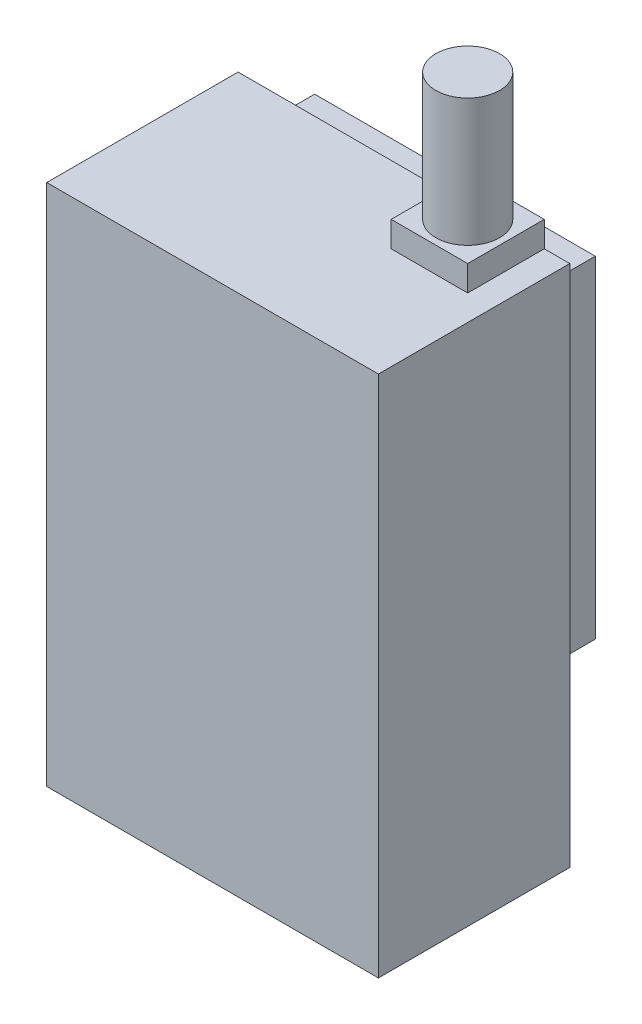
ISO-10303-21;
HEADER;
FILE_DESCRIPTION(('STEP AP214'),'2;1');
FILE_NAME('part.step','',(''),(''),'','','');
FILE_SCHEMA(('AUTOMOTIVE_DESIGN { 1 0 10303 214 1 1 1 1 }'));
ENDSEC;
DATA;
#1=APPLICATION_CONTEXT('core data for automotive mechanical design processes');
#2=APPLICATION_PROTOCOL_DEFINITION('international standard','automotive_design',2000,#1);
#3=PRODUCT_CONTEXT('',#1,'mechanical');
#4=PRODUCT('Part','Part','',(#3));
#5=PRODUCT_RELATED_PRODUCT_CATEGORY('part','',(#4));
#6=PRODUCT_DEFINITION_FORMATION('','',#4);
#7=PRODUCT_DEFINITION_CONTEXT('part definition',#1,'design');
#8=PRODUCT_DEFINITION('design','',#6,#7);
#9=PRODUCT_DEFINITION_SHAPE('','',#8);
#10=(LENGTH_UNIT() NAMED_UNIT(*) SI_UNIT(.MILLI.,.METRE.));
#11=(NAMED_UNIT(*) PLANE_ANGLE_UNIT() SI_UNIT($,.RADIAN.));
#12=(NAMED_UNIT(*) SI_UNIT($,.STERADIAN.) SOLID_ANGLE_UNIT());
#13=UNCERTAINTY_MEASURE_WITH_UNIT(LENGTH_MEASURE(1.E-05),#10,'distance_accuracy_value','');
#14=(GEOMETRIC_REPRESENTATION_CONTEXT(3) GLOBAL_UNCERTAINTY_ASSIGNED_CONTEXT((#13)) GLOBAL_UNIT_ASSIGNED_CONTEXT((#10,
#11,#12)) REPRESENTATION_CONTEXT('',''));
#15=CARTESIAN_POINT('',(0.,0.,0.));
#16=DIRECTION('',(0.,0.,1.));
#17=DIRECTION('',(1.,0.,0.));
#18=AXIS2_PLACEMENT_3D('',#15,#16,#17);
#19=CARTESIAN_POINT('',(-11.3200830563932,34.699792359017,0.));
#20=DIRECTION('',(0.,1.,0.));
#21=DIRECTION('',(0.,0.,1.));
#22=AXIS2_PLACEMENT_3D('',#19,#20,#21);
#23=PLANE('',#22);
#24=DIRECTION('',(0.,0.,1.));
#25=VECTOR('',#24,1.);
#26=CARTESIAN_POINT('',(-11.3200830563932,34.699792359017,6.));
#27=LINE('',#26,#25);
#28=CARTESIAN_POINT('',(-11.3200830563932,34.699792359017,0.));
#29=VERTEX_POINT('',#28);
#30=CARTESIAN_POINT('',(-11.3200830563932,34.699792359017,6.));
#31=VERTEX_POINT('',#30);
#32=EDGE_CURVE('E134',#29,#31,#27,.T.);
#33=ORIENTED_EDGE('',*,*,#32,.T.);
#34=DIRECTION('',(1.,0.,0.));
#35=VECTOR('',#34,1.);
#36=CARTESIAN_POINT('',(-5.32008305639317,34.699792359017,6.));
#37=LINE('',#36,#35);
#38=CARTESIAN_POINT('',(-5.32008305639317,34.699792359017,6.));
#39=VERTEX_POINT('',#38);
#40=EDGE_CURVE('E124',#31,#39,#37,.T.);
#41=ORIENTED_EDGE('',*,*,#40,.T.);
#42=DIRECTION('',(0.,0.,-1.));
#43=VECTOR('',#42,1.);
#44=CARTESIAN_POINT('',(-5.32008305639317,34.699792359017,6.));
#45=LINE('',#44,#43);
#46=CARTESIAN_POINT('',(-5.32008305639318,34.699792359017,0.));
#47=VERTEX_POINT('',#46);
#48=EDGE_CURVE('E133',#39,#47,#45,.T.);
#49=ORIENTED_EDGE('',*,*,#48,.T.);
#50=DIRECTION('',(-1.,0.,0.));
#51=VECTOR('',#50,1.);
#52=CARTESIAN_POINT('',(-5.32008305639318,34.699792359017,0.));
#53=LINE('',#52,#51);
#54=EDGE_CURVE('E139',#47,#29,#53,.T.);
#55=ORIENTED_EDGE('',*,*,#54,.T.);
#56=EDGE_LOOP('',(#33,#41,#49,#55));
#57=FACE_BOUND('',#56,.T.);
#58=CARTESIAN_POINT('',(-8.32008305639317,34.699792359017,3.));
#59=DIRECTION('',(0.,1.,0.));
#60=DIRECTION('',(0.,0.,1.));
#61=AXIS2_PLACEMENT_3D('',#58,#59,#60);
#62=CIRCLE('',#61,2.5);
#63=CARTESIAN_POINT('',(-8.32008305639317,34.699792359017,5.5));
#64=VERTEX_POINT('',#63);
#65=EDGE_CURVE('E250',#64,#64,#62,.T.);
#66=ORIENTED_EDGE('',*,*,#65,.F.);
#67=EDGE_LOOP('',(#66));
#68=FACE_BOUND('',#67,.T.);
#69=ADVANCED_FACE('F35',(#57,#68),#23,.T.);
#70=CARTESIAN_POINT('',(-29.3200830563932,32.699792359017,15.));
#71=DIRECTION('',(0.,-1.,0.));
#72=DIRECTION('',(0.,0.,-1.));
#73=AXIS2_PLACEMENT_3D('',#70,#71,#72);
#74=PLANE('',#73);
#75=DIRECTION('',(0.,0.,1.));
#76=VECTOR('',#75,1.);
#77=CARTESIAN_POINT('',(-11.3200830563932,32.699792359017,6.));
#78=LINE('',#77,#76);
#79=CARTESIAN_POINT('',(-11.3200830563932,32.699792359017,0.));
#80=VERTEX_POINT('',#79);
#81=CARTESIAN_POINT('',(-11.3200830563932,32.699792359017,6.));
#82=VERTEX_POINT('',#81);
#83=EDGE_CURVE('E57',#80,#82,#78,.T.);
#84=ORIENTED_EDGE('',*,*,#83,.F.);
#85=DIRECTION('',(-1.,0.,0.));
#86=VECTOR('',#85,1.);
#87=CARTESIAN_POINT('',(-29.3200830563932,32.699792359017,0.));
#88=LINE('',#87,#86);
#89=CARTESIAN_POINT('',(-29.3200830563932,32.699792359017,0.));
#90=VERTEX_POINT('',#89);
#91=EDGE_CURVE('E198',#80,#90,#88,.T.);
#92=ORIENTED_EDGE('',*,*,#91,.T.);
#93=DIRECTION('',(0.,0.,-1.));
#94=VECTOR('',#93,1.);
#95=CARTESIAN_POINT('',(-29.3200830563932,32.699792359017,15.));
#96=LINE('',#95,#94);
#97=CARTESIAN_POINT('',(-29.3200830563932,32.699792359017,15.));
#98=VERTEX_POINT('',#97);
#99=EDGE_CURVE('E44',#98,#90,#96,.T.);
#100=ORIENTED_EDGE('',*,*,#99,.F.);
#101=DIRECTION('',(-1.,0.,0.));
#102=VECTOR('',#101,1.);
#103=CARTESIAN_POINT('',(-29.3200830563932,32.699792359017,15.));
#104=LINE('',#103,#102);
#105=CARTESIAN_POINT('',(-3.32008305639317,32.699792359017,15.));
#106=VERTEX_POINT('',#105);
#107=EDGE_CURVE('E188',#106,#98,#104,.T.);
#108=ORIENTED_EDGE('',*,*,#107,.F.);
#109=DIRECTION('',(0.,0.,-1.));
#110=VECTOR('',#109,1.);
#111=CARTESIAN_POINT('',(-3.32008305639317,32.699792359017,15.));
#112=LINE('',#111,#110);
#113=CARTESIAN_POINT('',(-3.32008305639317,32.699792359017,0.));
#114=VERTEX_POINT('',#113);
#115=EDGE_CURVE('E11',#106,#114,#112,.T.);
#116=ORIENTED_EDGE('',*,*,#115,.T.);
#117=CARTESIAN_POINT('',(-5.32008305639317,32.699792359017,0.));
#118=VERTEX_POINT('',#117);
#119=EDGE_CURVE('E207',#114,#118,#88,.T.);
#120=ORIENTED_EDGE('',*,*,#119,.T.);
#121=DIRECTION('',(0.,0.,-1.));
#122=VECTOR('',#121,1.);
#123=CARTESIAN_POINT('',(-5.32008305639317,32.699792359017,6.));
#124=LINE('',#123,#122);
#125=CARTESIAN_POINT('',(-5.32008305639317,32.699792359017,6.));
#126=VERTEX_POINT('',#125);
#127=EDGE_CURVE('E143',#126,#118,#124,.T.);
#128=ORIENTED_EDGE('',*,*,#127,.F.);
#129=DIRECTION('',(1.,0.,0.));
#130=VECTOR('',#129,1.);
#131=CARTESIAN_POINT('',(-5.32008305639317,32.699792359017,6.));
#132=LINE('',#131,#130);
#133=EDGE_CURVE('E52',#82,#126,#132,.T.);
#134=ORIENTED_EDGE('',*,*,#133,.F.);
#135=EDGE_LOOP('',(#84,#92,#100,#108,#116,#120,#128,#134));
#136=FACE_BOUND('',#135,.T.);
#137=ADVANCED_FACE('F236',(#136),#74,.F.);
#138=CARTESIAN_POINT('',(-3.32008305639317,-8.30020764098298,0.));
#139=DIRECTION('',(0.,0.,1.));
#140=DIRECTION('',(1.,0.,0.));
#141=AXIS2_PLACEMENT_3D('',#138,#139,#140);
#142=PLANE('',#141);
#143=DIRECTION('',(0.,1.,0.));
#144=VECTOR('',#143,1.);
#145=CARTESIAN_POINT('',(-3.32008305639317,32.699792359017,0.));
#146=LINE('',#145,#144);
#147=CARTESIAN_POINT('',(-3.32008305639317,-8.30020764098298,0.));
#148=VERTEX_POINT('',#147);
#149=EDGE_CURVE('E184',#148,#114,#146,.T.);
#150=ORIENTED_EDGE('',*,*,#149,.F.);
#151=DIRECTION('',(1.,0.,0.));
#152=VECTOR('',#151,1.);
#153=CARTESIAN_POINT('',(-29.3200830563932,-8.30020764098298,0.));
#154=LINE('',#153,#152);
#155=CARTESIAN_POINT('',(-29.3200830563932,-8.30020764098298,0.));
#156=VERTEX_POINT('',#155);
#157=EDGE_CURVE('E189',#156,#148,#154,.T.);
#158=ORIENTED_EDGE('',*,*,#157,.F.);
#159=DIRECTION('',(0.,-1.,0.));
#160=VECTOR('',#159,1.);
#161=CARTESIAN_POINT('',(-29.3200830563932,32.699792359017,0.));
#162=LINE('',#161,#160);
#163=EDGE_CURVE('E201',#90,#156,#162,.T.);
#164=ORIENTED_EDGE('',*,*,#163,.F.);
#165=ORIENTED_EDGE('',*,*,#91,.F.);
#166=DIRECTION('',(0.,-1.,0.));
#167=VECTOR('',#166,1.);
#168=CARTESIAN_POINT('',(-11.3200830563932,34.699792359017,0.));
#169=LINE('',#168,#167);
#170=EDGE_CURVE('E237',#29,#80,#169,.T.);
#171=ORIENTED_EDGE('',*,*,#170,.F.);
#172=ORIENTED_EDGE('',*,*,#54,.F.);
#173=DIRECTION('',(0.,-1.,0.));
#174=VECTOR('',#173,1.);
#175=CARTESIAN_POINT('',(-5.32008305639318,34.699792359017,0.));
#176=LINE('',#175,#174);
#177=EDGE_CURVE('E151',#47,#118,#176,.T.);
#178=ORIENTED_EDGE('',*,*,#177,.T.);
#179=ORIENTED_EDGE('',*,*,#119,.F.);
#180=EDGE_LOOP('',(#150,#158,#164,#165,#171,#172,#178,#179));
#181=FACE_BOUND('',#180,.T.);
#182=DIRECTION('',(0.,-1.,0.));
#183=VECTOR('',#182,1.);
#184=CARTESIAN_POINT('',(-4.32008305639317,31.199792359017,0.));
#185=LINE('',#184,#183);
#186=CARTESIAN_POINT('',(-4.32008305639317,31.199792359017,0.));
#187=VERTEX_POINT('',#186);
#188=CARTESIAN_POINT('',(-4.32008305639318,5.19979235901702,0.));
#189=VERTEX_POINT('',#188);
#190=EDGE_CURVE('E146',#187,#189,#185,.T.);
#191=ORIENTED_EDGE('',*,*,#190,.F.);
#192=DIRECTION('',(1.,0.,0.));
#193=VECTOR('',#192,1.);
#194=CARTESIAN_POINT('',(-26.3200830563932,31.199792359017,0.));
#195=LINE('',#194,#193);
#196=CARTESIAN_POINT('',(-26.3200830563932,31.199792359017,0.));
#197=VERTEX_POINT('',#196);
#198=EDGE_CURVE('E159',#197,#187,#195,.T.);
#199=ORIENTED_EDGE('',*,*,#198,.F.);
#200=DIRECTION('',(0.,1.,0.));
#201=VECTOR('',#200,1.);
#202=CARTESIAN_POINT('',(-26.3200830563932,31.199792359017,0.));
#203=LINE('',#202,#201);
#204=CARTESIAN_POINT('',(-26.3200830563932,5.19979235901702,0.));
#205=VERTEX_POINT('',#204);
#206=EDGE_CURVE('E168',#205,#197,#203,.T.);
#207=ORIENTED_EDGE('',*,*,#206,.F.);
#208=DIRECTION('',(-1.,0.,0.));
#209=VECTOR('',#208,1.);
#210=CARTESIAN_POINT('',(-26.3200830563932,5.19979235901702,0.));
#211=LINE('',#210,#209);
#212=EDGE_CURVE('E149',#189,#205,#211,.T.);
#213=ORIENTED_EDGE('',*,*,#212,.F.);
#214=EDGE_LOOP('',(#191,#199,#207,#213));
#215=FACE_BOUND('',#214,.T.);
#216=ADVANCED_FACE('F228',(#181,#215),#142,.F.);
#217=CARTESIAN_POINT('',(-3.32008305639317,32.699792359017,15.));
#218=DIRECTION('',(-1.,0.,0.));
#219=DIRECTION('',(0.,-1.,0.));
#220=AXIS2_PLACEMENT_3D('',#217,#218,#219);
#221=PLANE('',#220);
#222=ORIENTED_EDGE('',*,*,#149,.T.);
#223=ORIENTED_EDGE('',*,*,#115,.F.);
#224=DIRECTION('',(0.,1.,0.));
#225=VECTOR('',#224,1.);
#226=CARTESIAN_POINT('',(-3.32008305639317,32.699792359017,15.));
#227=LINE('',#226,#225);
#228=CARTESIAN_POINT('',(-3.32008305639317,-8.30020764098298,15.));
#229=VERTEX_POINT('',#228);
#230=EDGE_CURVE('E185',#229,#106,#227,.T.);
#231=ORIENTED_EDGE('',*,*,#230,.F.);
#232=DIRECTION('',(0.,0.,-1.));
#233=VECTOR('',#232,1.);
#234=CARTESIAN_POINT('',(-3.32008305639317,-8.30020764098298,15.));
#235=LINE('',#234,#233);
#236=EDGE_CURVE('E195',#229,#148,#235,.T.);
#237=ORIENTED_EDGE('',*,*,#236,.T.);
#238=EDGE_LOOP('',(#222,#223,#231,#237));
#239=FACE_BOUND('',#238,.T.);
#240=ADVANCED_FACE('F37',(#239),#221,.F.);
#241=CARTESIAN_POINT('',(-29.3200830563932,32.699792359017,15.));
#242=DIRECTION('',(1.,0.,0.));
#243=DIRECTION('',(0.,1.,0.));
#244=AXIS2_PLACEMENT_3D('',#241,#242,#243);
#245=PLANE('',#244);
#246=ORIENTED_EDGE('',*,*,#163,.T.);
#247=DIRECTION('',(0.,0.,-1.));
#248=VECTOR('',#247,1.);
#249=CARTESIAN_POINT('',(-29.3200830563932,-8.30020764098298,15.));
#250=LINE('',#249,#248);
#251=CARTESIAN_POINT('',(-29.3200830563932,-8.30020764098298,15.));
#252=VERTEX_POINT('',#251);
#253=EDGE_CURVE('E211',#252,#156,#250,.T.);
#254=ORIENTED_EDGE('',*,*,#253,.F.);
#255=DIRECTION('',(0.,-1.,0.));
#256=VECTOR('',#255,1.);
#257=CARTESIAN_POINT('',(-29.3200830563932,32.699792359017,15.));
#258=LINE('',#257,#256);
#259=EDGE_CURVE('E191',#98,#252,#258,.T.);
#260=ORIENTED_EDGE('',*,*,#259,.F.);
#261=ORIENTED_EDGE('',*,*,#99,.T.);
#262=EDGE_LOOP('',(#246,#254,#260,#261));
#263=FACE_BOUND('',#262,.T.);
#264=ADVANCED_FACE('F221',(#263),#245,.F.);
#265=CARTESIAN_POINT('',(-29.3200830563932,-8.30020764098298,15.));
#266=DIRECTION('',(0.,1.,0.));
#267=DIRECTION('',(0.,0.,1.));
#268=AXIS2_PLACEMENT_3D('',#265,#266,#267);
#269=PLANE('',#268);
#270=ORIENTED_EDGE('',*,*,#157,.T.);
#271=ORIENTED_EDGE('',*,*,#236,.F.);
#272=DIRECTION('',(1.,0.,0.));
#273=VECTOR('',#272,1.);
#274=CARTESIAN_POINT('',(-29.3200830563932,-8.30020764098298,15.));
#275=LINE('',#274,#273);
#276=EDGE_CURVE('E193',#252,#229,#275,.T.);
#277=ORIENTED_EDGE('',*,*,#276,.F.);
#278=ORIENTED_EDGE('',*,*,#253,.T.);
#279=EDGE_LOOP('',(#270,#271,#277,#278));
#280=FACE_BOUND('',#279,.T.);
#281=ADVANCED_FACE('F226',(#280),#269,.F.);
#282=CARTESIAN_POINT('',(-3.32008305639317,-8.30020764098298,15.));
#283=DIRECTION('',(0.,0.,1.));
#284=DIRECTION('',(1.,0.,0.));
#285=AXIS2_PLACEMENT_3D('',#282,#283,#284);
#286=PLANE('',#285);
#287=ORIENTED_EDGE('',*,*,#230,.T.);
#288=ORIENTED_EDGE('',*,*,#107,.T.);
#289=ORIENTED_EDGE('',*,*,#259,.T.);
#290=ORIENTED_EDGE('',*,*,#276,.T.);
#291=EDGE_LOOP('',(#287,#288,#289,#290));
#292=FACE_BOUND('',#291,.T.);
#293=ADVANCED_FACE('F235',(#292),#286,.T.);
#294=CARTESIAN_POINT('',(-4.32008305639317,31.199792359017,-3.));
#295=DIRECTION('',(-1.,0.,0.));
#296=DIRECTION('',(0.,-1.,0.));
#297=AXIS2_PLACEMENT_3D('',#294,#295,#296);
#298=PLANE('',#297);
#299=ORIENTED_EDGE('',*,*,#190,.T.);
#300=DIRECTION('',(0.,0.,1.));
#301=VECTOR('',#300,1.);
#302=CARTESIAN_POINT('',(-4.32008305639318,5.19979235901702,-3.));
#303=LINE('',#302,#301);
#304=CARTESIAN_POINT('',(-4.32008305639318,5.19979235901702,-3.));
#305=VERTEX_POINT('',#304);
#306=EDGE_CURVE('E181',#305,#189,#303,.T.);
#307=ORIENTED_EDGE('',*,*,#306,.F.);
#308=DIRECTION('',(0.,-1.,0.));
#309=VECTOR('',#308,1.);
#310=CARTESIAN_POINT('',(-4.32008305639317,31.199792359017,-3.));
#311=LINE('',#310,#309);
#312=CARTESIAN_POINT('',(-4.32008305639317,31.199792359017,-3.));
#313=VERTEX_POINT('',#312);
#314=EDGE_CURVE('E155',#313,#305,#311,.T.);
#315=ORIENTED_EDGE('',*,*,#314,.F.);
#316=DIRECTION('',(0.,0.,1.));
#317=VECTOR('',#316,1.);
#318=CARTESIAN_POINT('',(-4.32008305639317,31.199792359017,-3.));
#319=LINE('',#318,#317);
#320=EDGE_CURVE('E164',#313,#187,#319,.T.);
#321=ORIENTED_EDGE('',*,*,#320,.T.);
#322=EDGE_LOOP('',(#299,#307,#315,#321));
#323=FACE_BOUND('',#322,.T.);
#324=ADVANCED_FACE('F294',(#323),#298,.F.);
#325=CARTESIAN_POINT('',(-26.3200830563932,5.19979235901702,-3.));
#326=DIRECTION('',(0.,1.,0.));
#327=DIRECTION('',(-1.,0.,0.));
#328=AXIS2_PLACEMENT_3D('',#325,#326,#327);
#329=PLANE('',#328);
#330=ORIENTED_EDGE('',*,*,#212,.T.);
#331=DIRECTION('',(0.,0.,1.));
#332=VECTOR('',#331,1.);
#333=CARTESIAN_POINT('',(-26.3200830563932,5.19979235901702,-3.));
#334=LINE('',#333,#332);
#335=CARTESIAN_POINT('',(-26.3200830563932,5.19979235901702,-3.));
#336=VERTEX_POINT('',#335);
#337=EDGE_CURVE('E178',#336,#205,#334,.T.);
#338=ORIENTED_EDGE('',*,*,#337,.F.);
#339=DIRECTION('',(-1.,0.,0.));
#340=VECTOR('',#339,1.);
#341=CARTESIAN_POINT('',(-26.3200830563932,5.19979235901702,-3.));
#342=LINE('',#341,#340);
#343=EDGE_CURVE('E158',#305,#336,#342,.T.);
#344=ORIENTED_EDGE('',*,*,#343,.F.);
#345=ORIENTED_EDGE('',*,*,#306,.T.);
#346=EDGE_LOOP('',(#330,#338,#344,#345));
#347=FACE_BOUND('',#346,.T.);
#348=ADVANCED_FACE('F290',(#347),#329,.F.);
#349=CARTESIAN_POINT('',(-26.3200830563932,31.199792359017,-3.));
#350=DIRECTION('',(1.,0.,0.));
#351=DIRECTION('',(0.,1.,0.));
#352=AXIS2_PLACEMENT_3D('',#349,#350,#351);
#353=PLANE('',#352);
#354=ORIENTED_EDGE('',*,*,#206,.T.);
#355=DIRECTION('',(0.,0.,1.));
#356=VECTOR('',#355,1.);
#357=CARTESIAN_POINT('',(-26.3200830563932,31.199792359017,-3.));
#358=LINE('',#357,#356);
#359=CARTESIAN_POINT('',(-26.3200830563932,31.199792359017,-3.));
#360=VERTEX_POINT('',#359);
#361=EDGE_CURVE('E175',#360,#197,#358,.T.);
#362=ORIENTED_EDGE('',*,*,#361,.F.);
#363=DIRECTION('',(0.,1.,0.));
#364=VECTOR('',#363,1.);
#365=CARTESIAN_POINT('',(-26.3200830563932,31.199792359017,-3.));
#366=LINE('',#365,#364);
#367=EDGE_CURVE('E161',#336,#360,#366,.T.);
#368=ORIENTED_EDGE('',*,*,#367,.F.);
#369=ORIENTED_EDGE('',*,*,#337,.T.);
#370=EDGE_LOOP('',(#354,#362,#368,#369));
#371=FACE_BOUND('',#370,.T.);
#372=ADVANCED_FACE('F286',(#371),#353,.F.);
#373=CARTESIAN_POINT('',(-26.3200830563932,31.199792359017,-3.));
#374=DIRECTION('',(0.,-1.,0.));
#375=DIRECTION('',(1.,0.,0.));
#376=AXIS2_PLACEMENT_3D('',#373,#374,#375);
#377=PLANE('',#376);
#378=ORIENTED_EDGE('',*,*,#198,.T.);
#379=ORIENTED_EDGE('',*,*,#320,.F.);
#380=DIRECTION('',(1.,0.,0.));
#381=VECTOR('',#380,1.);
#382=CARTESIAN_POINT('',(-26.3200830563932,31.199792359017,-3.));
#383=LINE('',#382,#381);
#384=EDGE_CURVE('E163',#360,#313,#383,.T.);
#385=ORIENTED_EDGE('',*,*,#384,.F.);
#386=ORIENTED_EDGE('',*,*,#361,.T.);
#387=EDGE_LOOP('',(#378,#379,#385,#386));
#388=FACE_BOUND('',#387,.T.);
#389=ADVANCED_FACE('F282',(#388),#377,.F.);
#390=CARTESIAN_POINT('',(-4.32008305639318,5.19979235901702,-3.));
#391=DIRECTION('',(0.,0.,1.));
#392=DIRECTION('',(1.,0.,0.));
#393=AXIS2_PLACEMENT_3D('',#390,#391,#392);
#394=PLANE('',#393);
#395=ORIENTED_EDGE('',*,*,#314,.T.);
#396=ORIENTED_EDGE('',*,*,#343,.T.);
#397=ORIENTED_EDGE('',*,*,#367,.T.);
#398=ORIENTED_EDGE('',*,*,#384,.T.);
#399=EDGE_LOOP('',(#395,#396,#397,#398));
#400=FACE_BOUND('',#399,.T.);
#401=ADVANCED_FACE('F279',(#400),#394,.F.);
#402=CARTESIAN_POINT('',(-11.3200830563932,34.699792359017,6.));
#403=DIRECTION('',(1.,0.,0.));
#404=DIRECTION('',(0.,0.,-1.));
#405=AXIS2_PLACEMENT_3D('',#402,#403,#404);
#406=PLANE('',#405);
#407=ORIENTED_EDGE('',*,*,#83,.T.);
#408=DIRECTION('',(0.,-1.,0.));
#409=VECTOR('',#408,1.);
#410=CARTESIAN_POINT('',(-11.3200830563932,34.699792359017,6.));
#411=LINE('',#410,#409);
#412=EDGE_CURVE('E128',#31,#82,#411,.T.);
#413=ORIENTED_EDGE('',*,*,#412,.F.);
#414=ORIENTED_EDGE('',*,*,#32,.F.);
#415=ORIENTED_EDGE('',*,*,#170,.T.);
#416=EDGE_LOOP('',(#407,#413,#414,#415));
#417=FACE_BOUND('',#416,.T.);
#418=ADVANCED_FACE('F145',(#417),#406,.F.);
#419=CARTESIAN_POINT('',(-5.32008305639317,34.699792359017,6.));
#420=DIRECTION('',(0.,0.,-1.));
#421=DIRECTION('',(-1.,0.,0.));
#422=AXIS2_PLACEMENT_3D('',#419,#420,#421);
#423=PLANE('',#422);
#424=ORIENTED_EDGE('',*,*,#133,.T.);
#425=DIRECTION('',(0.,-1.,0.));
#426=VECTOR('',#425,1.);
#427=CARTESIAN_POINT('',(-5.32008305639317,34.699792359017,6.));
#428=LINE('',#427,#426);
#429=EDGE_CURVE('E130',#39,#126,#428,.T.);
#430=ORIENTED_EDGE('',*,*,#429,.F.);
#431=ORIENTED_EDGE('',*,*,#40,.F.);
#432=ORIENTED_EDGE('',*,*,#412,.T.);
#433=EDGE_LOOP('',(#424,#430,#431,#432));
#434=FACE_BOUND('',#433,.T.);
#435=ADVANCED_FACE('F126',(#434),#423,.F.);
#436=CARTESIAN_POINT('',(-5.32008305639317,34.699792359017,6.));
#437=DIRECTION('',(-1.,0.,0.));
#438=DIRECTION('',(0.,0.,1.));
#439=AXIS2_PLACEMENT_3D('',#436,#437,#438);
#440=PLANE('',#439);
#441=ORIENTED_EDGE('',*,*,#127,.T.);
#442=ORIENTED_EDGE('',*,*,#177,.F.);
#443=ORIENTED_EDGE('',*,*,#48,.F.);
#444=ORIENTED_EDGE('',*,*,#429,.T.);
#445=EDGE_LOOP('',(#441,#442,#443,#444));
#446=FACE_BOUND('',#445,.T.);
#447=ADVANCED_FACE('F262',(#446),#440,.F.);
#448=CARTESIAN_POINT('',(-8.32008305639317,44.699792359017,3.));
#449=DIRECTION('',(0.,-1.,0.));
#450=DIRECTION('',(0.,0.,-1.));
#451=AXIS2_PLACEMENT_3D('',#448,#449,#450);
#452=CYLINDRICAL_SURFACE('',#451,2.5);
#453=CARTESIAN_POINT('',(-8.32008305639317,44.699792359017,3.));
#454=DIRECTION('',(0.,1.,0.));
#455=DIRECTION('',(0.,0.,1.));
#456=AXIS2_PLACEMENT_3D('',#453,#454,#455);
#457=CIRCLE('',#456,2.5);
#458=CARTESIAN_POINT('',(-8.32008305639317,44.699792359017,5.5));
#459=VERTEX_POINT('',#458);
#460=EDGE_CURVE('E253',#459,#459,#457,.T.);
#461=ORIENTED_EDGE('',*,*,#460,.F.);
#462=EDGE_LOOP('',(#461));
#463=FACE_BOUND('',#462,.T.);
#464=ORIENTED_EDGE('',*,*,#65,.T.);
#465=EDGE_LOOP('',(#464));
#466=FACE_BOUND('',#465,.T.);
#467=ADVANCED_FACE('F259',(#463,#466),#452,.T.);
#468=CARTESIAN_POINT('',(-8.32008305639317,44.699792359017,3.));
#469=DIRECTION('',(0.,1.,0.));
#470=DIRECTION('',(0.,0.,1.));
#471=AXIS2_PLACEMENT_3D('',#468,#469,#470);
#472=PLANE('',#471);
#473=ORIENTED_EDGE('',*,*,#460,.T.);
#474=EDGE_LOOP('',(#473));
#475=FACE_BOUND('',#474,.T.);
#476=ADVANCED_FACE('F257',(#475),#472,.T.);
#477=CLOSED_SHELL('',(#69,#137,#216,#240,#264,#281,#293,#324,#348,#372,#389,#401,#418,#435,#447,
#467,#476));
#478=MANIFOLD_SOLID_BREP('B2',#477);
#479=ADVANCED_BREP_SHAPE_REPRESENTATION('',(#18,#478),#14);
#480=SHAPE_DEFINITION_REPRESENTATION(#9,#479);
ENDSEC;
END-ISO-10303-21;
